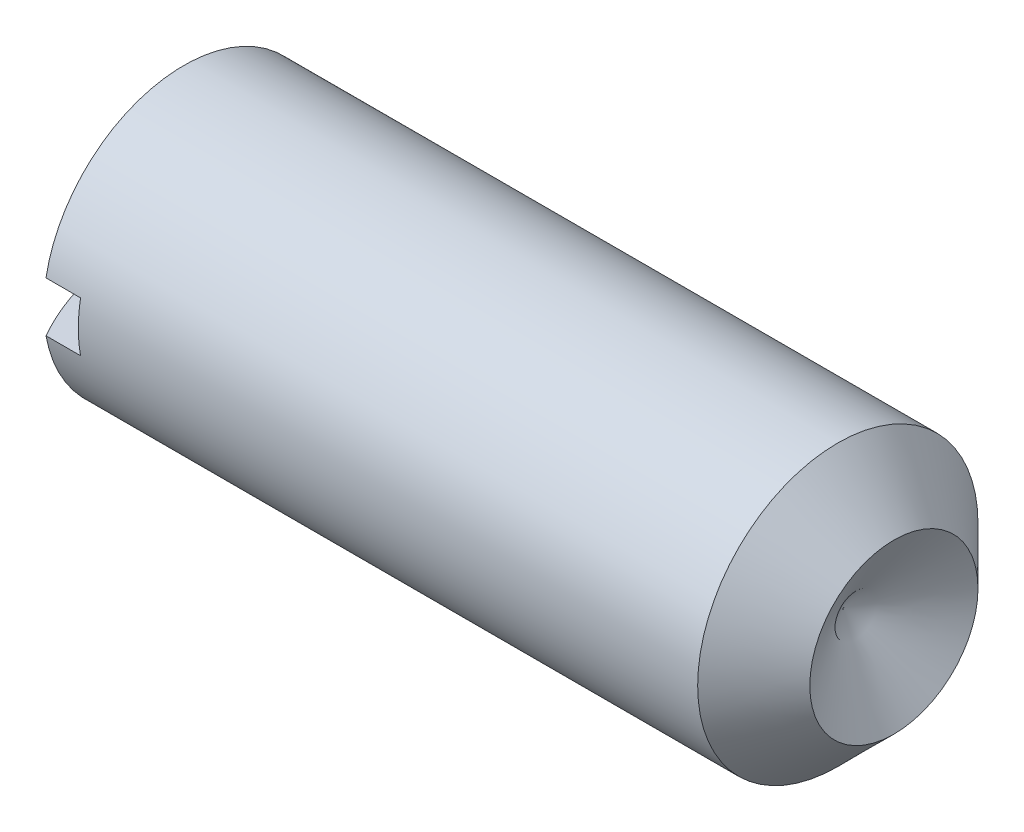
ISO-10303-21;
HEADER;
FILE_DESCRIPTION(('STEP AP214'),'2;1');
FILE_NAME('part.step','',(''),(''),'','','');
FILE_SCHEMA(('AUTOMOTIVE_DESIGN { 1 0 10303 214 1 1 1 1 }'));
ENDSEC;
DATA;
#1=APPLICATION_CONTEXT('core data for automotive mechanical design processes');
#2=APPLICATION_PROTOCOL_DEFINITION('international standard','automotive_design',2000,#1);
#3=PRODUCT_CONTEXT('',#1,'mechanical');
#4=PRODUCT('Part','Part','',(#3));
#5=PRODUCT_RELATED_PRODUCT_CATEGORY('part','',(#4));
#6=PRODUCT_DEFINITION_FORMATION('','',#4);
#7=PRODUCT_DEFINITION_CONTEXT('part definition',#1,'design');
#8=PRODUCT_DEFINITION('design','',#6,#7);
#9=PRODUCT_DEFINITION_SHAPE('','',#8);
#10=(LENGTH_UNIT() NAMED_UNIT(*) SI_UNIT(.MILLI.,.METRE.));
#11=(NAMED_UNIT(*) PLANE_ANGLE_UNIT() SI_UNIT($,.RADIAN.));
#12=(NAMED_UNIT(*) SI_UNIT($,.STERADIAN.) SOLID_ANGLE_UNIT());
#13=UNCERTAINTY_MEASURE_WITH_UNIT(LENGTH_MEASURE(1.E-05),#10,'distance_accuracy_value','');
#14=(GEOMETRIC_REPRESENTATION_CONTEXT(3) GLOBAL_UNCERTAINTY_ASSIGNED_CONTEXT((#13)) GLOBAL_UNIT_ASSIGNED_CONTEXT((#10,
#11,#12)) REPRESENTATION_CONTEXT('',''));
#15=CARTESIAN_POINT('',(0.,0.,0.));
#16=DIRECTION('',(0.,0.,1.));
#17=DIRECTION('',(1.,0.,0.));
#18=AXIS2_PLACEMENT_3D('',#15,#16,#17);
#19=CARTESIAN_POINT('',(19.05,0.,0.));
#20=DIRECTION('',(-1.,0.,0.));
#21=DIRECTION('',(0.,1.,0.));
#22=AXIS2_PLACEMENT_3D('',#19,#20,#21);
#23=SPHERICAL_SURFACE('',#22,19.05);
#24=CARTESIAN_POINT('',(19.05,1.7018,0.));
#25=DIRECTION('',(0.,-1.,0.));
#26=DIRECTION('',(0.,0.,-1.));
#27=AXIS2_PLACEMENT_3D('',#24,#25,#26);
#28=CIRCLE('',#27,18.9738340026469);
#29=CARTESIAN_POINT('',(2.55221605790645,1.7018,9.37173952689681));
#30=VERTEX_POINT('',#29);
#31=CARTESIAN_POINT('',(2.55221605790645,1.7018,-9.37173952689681));
#32=VERTEX_POINT('',#31);
#33=EDGE_CURVE('E98',#30,#32,#28,.T.);
#34=ORIENTED_EDGE('',*,*,#33,.F.);
#35=CARTESIAN_POINT('',(2.55221605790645,0.,0.));
#36=DIRECTION('',(-1.,0.,0.));
#37=DIRECTION('',(0.,0.,1.));
#38=AXIS2_PLACEMENT_3D('',#35,#36,#37);
#39=CIRCLE('',#38,9.525);
#40=EDGE_CURVE('E89',#30,#32,#39,.T.);
#41=ORIENTED_EDGE('',*,*,#40,.T.);
#42=EDGE_LOOP('',(#34,#41));
#43=FACE_BOUND('',#42,.T.);
#44=ADVANCED_FACE('F32',(#43),#23,.T.);
#45=CARTESIAN_POINT('',(19.05,-1.7018,0.));
#46=DIRECTION('',(0.,1.,0.));
#47=DIRECTION('',(0.,0.,1.));
#48=AXIS2_PLACEMENT_3D('',#45,#46,#47);
#49=CIRCLE('',#48,18.9738340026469);
#50=CARTESIAN_POINT('',(2.55221605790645,-1.7018,-9.37173952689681));
#51=VERTEX_POINT('',#50);
#52=CARTESIAN_POINT('',(2.55221605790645,-1.7018,9.37173952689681));
#53=VERTEX_POINT('',#52);
#54=EDGE_CURVE('E112',#51,#53,#49,.T.);
#55=ORIENTED_EDGE('',*,*,#54,.F.);
#56=EDGE_CURVE('E92',#51,#53,#39,.T.);
#57=ORIENTED_EDGE('',*,*,#56,.T.);
#58=EDGE_LOOP('',(#55,#57));
#59=FACE_BOUND('',#58,.T.);
#60=ADVANCED_FACE('F111',(#59),#23,.T.);
#61=CARTESIAN_POINT('',(-12.7,0.,0.));
#62=DIRECTION('',(-1.,0.,0.));
#63=DIRECTION('',(0.,0.,1.));
#64=AXIS2_PLACEMENT_3D('',#61,#62,#63);
#65=CYLINDRICAL_SURFACE('',#64,9.525);
#66=CARTESIAN_POINT('',(46.99,0.,0.));
#67=DIRECTION('',(-1.,0.,0.));
#68=DIRECTION('',(0.,0.,1.));
#69=AXIS2_PLACEMENT_3D('',#66,#67,#68);
#70=CIRCLE('',#69,9.525);
#71=CARTESIAN_POINT('',(46.99,0.,9.525));
#72=VERTEX_POINT('',#71);
#73=EDGE_CURVE('E91',#72,#72,#70,.T.);
#74=ORIENTED_EDGE('',*,*,#73,.T.);
#75=EDGE_LOOP('',(#74));
#76=FACE_BOUND('',#75,.T.);
#77=ORIENTED_EDGE('',*,*,#40,.F.);
#78=DIRECTION('',(-1.,0.,0.));
#79=VECTOR('',#78,1.);
#80=CARTESIAN_POINT('',(-12.7,1.7018,9.37173952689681));
#81=LINE('',#80,#79);
#82=CARTESIAN_POINT('',(4.9022,1.7018,9.37173952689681));
#83=VERTEX_POINT('',#82);
#84=EDGE_CURVE('E11',#30,#83,#81,.F.);
#85=ORIENTED_EDGE('',*,*,#84,.T.);
#86=CARTESIAN_POINT('',(4.9022,0.,0.));
#87=DIRECTION('',(1.,0.,0.));
#88=DIRECTION('',(0.,0.,-1.));
#89=AXIS2_PLACEMENT_3D('',#86,#87,#88);
#90=CIRCLE('',#89,9.525);
#91=CARTESIAN_POINT('',(4.9022,-1.7018,9.37173952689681));
#92=VERTEX_POINT('',#91);
#93=EDGE_CURVE('E70',#92,#83,#90,.F.);
#94=ORIENTED_EDGE('',*,*,#93,.F.);
#95=DIRECTION('',(-1.,0.,0.));
#96=VECTOR('',#95,1.);
#97=CARTESIAN_POINT('',(-12.7,-1.7018,9.37173952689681));
#98=LINE('',#97,#96);
#99=EDGE_CURVE('E39',#92,#53,#98,.T.);
#100=ORIENTED_EDGE('',*,*,#99,.T.);
#101=ORIENTED_EDGE('',*,*,#56,.F.);
#102=DIRECTION('',(-1.,0.,0.));
#103=VECTOR('',#102,1.);
#104=CARTESIAN_POINT('',(-12.7,-1.7018,-9.37173952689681));
#105=LINE('',#104,#103);
#106=CARTESIAN_POINT('',(4.9022,-1.7018,-9.37173952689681));
#107=VERTEX_POINT('',#106);
#108=EDGE_CURVE('E104',#51,#107,#105,.F.);
#109=ORIENTED_EDGE('',*,*,#108,.T.);
#110=CARTESIAN_POINT('',(4.9022,1.7018,-9.37173952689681));
#111=VERTEX_POINT('',#110);
#112=EDGE_CURVE('E79',#111,#107,#90,.F.);
#113=ORIENTED_EDGE('',*,*,#112,.F.);
#114=DIRECTION('',(-1.,0.,0.));
#115=VECTOR('',#114,1.);
#116=CARTESIAN_POINT('',(-12.7,1.7018,-9.37173952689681));
#117=LINE('',#116,#115);
#118=EDGE_CURVE('E77',#111,#32,#117,.T.);
#119=ORIENTED_EDGE('',*,*,#118,.T.);
#120=EDGE_LOOP('',(#77,#85,#94,#100,#101,#109,#113,#119));
#121=FACE_BOUND('',#120,.T.);
#122=ADVANCED_FACE('F87',(#76,#121),#65,.T.);
#123=CARTESIAN_POINT('',(50.8,0.,0.));
#124=DIRECTION('',(1.,0.,0.));
#125=DIRECTION('',(0.,0.,-1.));
#126=AXIS2_PLACEMENT_3D('',#123,#124,#125);
#127=CONICAL_SURFACE('',#126,5.715,1.02974425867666);
#128=CARTESIAN_POINT('',(47.3660815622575,0.,0.));
#129=VERTEX_POINT('',#128);
#130=VERTEX_LOOP('',#129);
#131=FACE_BOUND('',#130,.T.);
#132=CARTESIAN_POINT('',(50.8,0.,0.));
#133=DIRECTION('',(-1.,0.,0.));
#134=DIRECTION('',(0.,0.,1.));
#135=AXIS2_PLACEMENT_3D('',#132,#133,#134);
#136=CIRCLE('',#135,5.715);
#137=CARTESIAN_POINT('',(50.8,0.,5.715));
#138=VERTEX_POINT('',#137);
#139=EDGE_CURVE('E95',#138,#138,#136,.T.);
#140=ORIENTED_EDGE('',*,*,#139,.F.);
#141=EDGE_LOOP('',(#140));
#142=FACE_BOUND('',#141,.T.);
#143=ADVANCED_FACE('F131',(#131,#142),#127,.F.);
#144=CARTESIAN_POINT('',(50.8,0.,0.));
#145=DIRECTION('',(-1.,0.,0.));
#146=DIRECTION('',(0.,0.,1.));
#147=AXIS2_PLACEMENT_3D('',#144,#145,#146);
#148=CONICAL_SURFACE('',#147,5.715,0.785398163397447);
#149=ORIENTED_EDGE('',*,*,#73,.F.);
#150=EDGE_LOOP('',(#149));
#151=FACE_BOUND('',#150,.T.);
#152=ORIENTED_EDGE('',*,*,#139,.T.);
#153=EDGE_LOOP('',(#152));
#154=FACE_BOUND('',#153,.T.);
#155=ADVANCED_FACE('F122',(#151,#154),#148,.T.);
#156=CARTESIAN_POINT('',(4.9022,1.7018,-9.52499999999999));
#157=DIRECTION('',(0.,-1.,0.));
#158=DIRECTION('',(0.,0.,-1.));
#159=AXIS2_PLACEMENT_3D('',#156,#157,#158);
#160=PLANE('',#159);
#161=ORIENTED_EDGE('',*,*,#33,.T.);
#162=ORIENTED_EDGE('',*,*,#118,.F.);
#163=DIRECTION('',(0.,0.,1.));
#164=VECTOR('',#163,1.);
#165=CARTESIAN_POINT('',(4.9022,1.7018,-9.52499999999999));
#166=LINE('',#165,#164);
#167=EDGE_CURVE('E46',#111,#83,#166,.T.);
#168=ORIENTED_EDGE('',*,*,#167,.T.);
#169=ORIENTED_EDGE('',*,*,#84,.F.);
#170=EDGE_LOOP('',(#161,#162,#168,#169));
#171=FACE_BOUND('',#170,.T.);
#172=ADVANCED_FACE('F81',(#171),#160,.T.);
#173=CARTESIAN_POINT('',(4.9022,-1.7018,-9.52499999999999));
#174=DIRECTION('',(0.,1.,0.));
#175=DIRECTION('',(0.,0.,1.));
#176=AXIS2_PLACEMENT_3D('',#173,#174,#175);
#177=PLANE('',#176);
#178=ORIENTED_EDGE('',*,*,#54,.T.);
#179=ORIENTED_EDGE('',*,*,#99,.F.);
#180=DIRECTION('',(0.,0.,-1.));
#181=VECTOR('',#180,1.);
#182=CARTESIAN_POINT('',(4.9022,-1.7018,-9.52499999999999));
#183=LINE('',#182,#181);
#184=EDGE_CURVE('E73',#92,#107,#183,.T.);
#185=ORIENTED_EDGE('',*,*,#184,.T.);
#186=ORIENTED_EDGE('',*,*,#108,.F.);
#187=EDGE_LOOP('',(#178,#179,#185,#186));
#188=FACE_BOUND('',#187,.T.);
#189=ADVANCED_FACE('F114',(#188),#177,.T.);
#190=CARTESIAN_POINT('',(4.9022,1.7018,-9.52499999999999));
#191=DIRECTION('',(1.,0.,0.));
#192=DIRECTION('',(0.,0.,-1.));
#193=AXIS2_PLACEMENT_3D('',#190,#191,#192);
#194=PLANE('',#193);
#195=ORIENTED_EDGE('',*,*,#184,.F.);
#196=ORIENTED_EDGE('',*,*,#93,.T.);
#197=ORIENTED_EDGE('',*,*,#167,.F.);
#198=ORIENTED_EDGE('',*,*,#112,.T.);
#199=EDGE_LOOP('',(#195,#196,#197,#198));
#200=FACE_BOUND('',#199,.T.);
#201=ADVANCED_FACE('F71',(#200),#194,.F.);
#202=CLOSED_SHELL('',(#44,#60,#122,#143,#155,#172,#189,#201));
#203=MANIFOLD_SOLID_BREP('B2',#202);
#204=ADVANCED_BREP_SHAPE_REPRESENTATION('',(#18,#203),#14);
#205=SHAPE_DEFINITION_REPRESENTATION(#9,#204);
ENDSEC;
END-ISO-10303-21;
